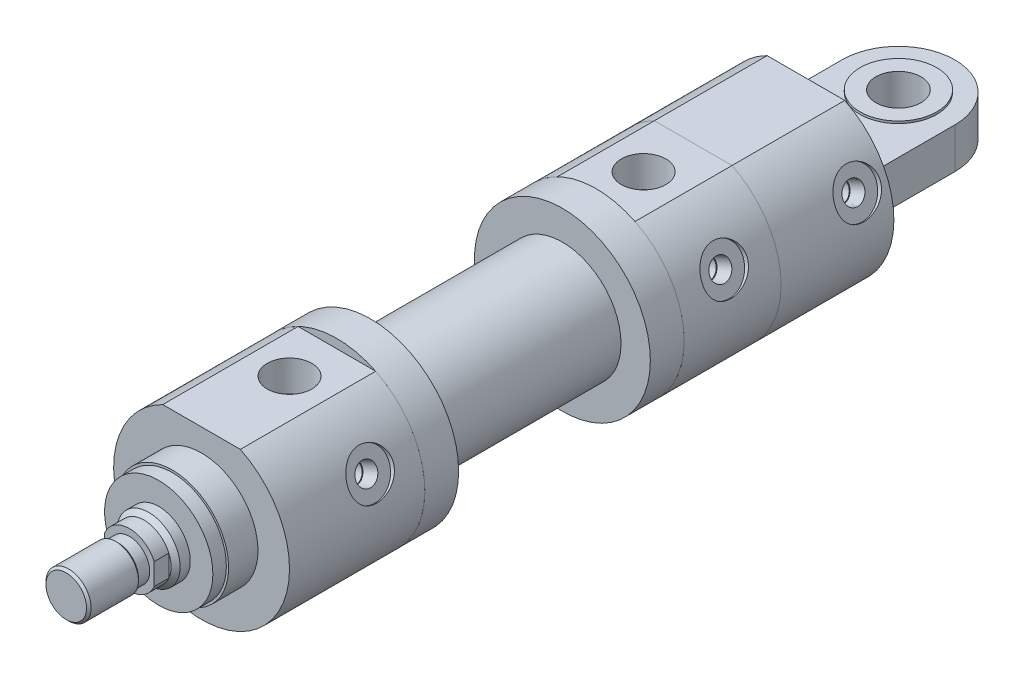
from build123d import *

# Parameters (mm, degrees)
ESQUISSE1_R             = 39
EXTRUSION1_DEPTH        = 43
ESQUISSE2_R             = 39
EXTRUSION2_DEPTH        = 15
ENL_V_START             = 35
ESQUISSE3_W             = 78
ESQUISSE3_H             = 43
ENL_V_MAT_EXTRU_1_DEPTH = 46.037491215
ESQUISSE6_R             = 26
EXTRUSION3_DEPTH        = 85
ESQUISSE7_R             = 39
EXTRUSION4_DEPTH        = 15
ESQUISSE8_R             = 39
EXTRUSION5_DEPTH        = 60
ESQUISSE9_W             = 78
ESQUISSE9_H             = 122
ENL_V_MAT_EXTRU_2_DEPTH = 57
ESQUISSE10_R            = 25
EXTRUSION6_DEPTH        = 13
ESQUISSE11_R            = 24
EXTRUSION7_DEPTH        = 6
ESQUISSE12_R            = 14
EXTRUSION8_DEPTH        = 6.5
CHANFREIN1_SIZE         = 2
ESQUISSE13_R            = 12
EXTRUSION9_DEPTH        = 6.5
ESQUISSE16_W            = 7.610310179
ESQUISSE16_H            = 44.412407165
ENL_V_MAT_EXTRU_4_DEPTH = 6.5
ESQUISSE17_R            = 39
EXTRUSION10_DEPTH       = 50
ESQUISSE18_W            = 78
ESQUISSE18_H            = 50
ENL_V_MAT_EXTRU_5_DEPTH = 249.418418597
ESQUISSE19_R            = 10
EXTRUSION11_DEPTH       = 9
ESQUISSE20_R            = 17
ESQUISSE20_R_2          = 10
EXTRUSION12_DEPTH       = 10
ENL_V_START_2           = 39
ESQUISSE21_R            = 10
ENL_V_MAT_EXTRU_6_DEPTH = 2
ESQUISSE22_R            = 10
ENL_V_MAT_EXTRU_7_DEPTH = 2
ESQUISSE23_R            = 10
ENL_V_MAT_EXTRU_8_DEPTH = 2


with BuildPart() as part:
    # Esquisse1 → Extrusion1 (new body)
    with BuildSketch(Plane.XY):
        Circle(ESQUISSE1_R)
    extrude(amount=EXTRUSION1_DEPTH)

    # Esquisse3 → Enl_v. mat.-Extru.1 (cut, through all)
    with BuildSketch(Plane(origin=(0, 0, 0), x_dir=(1, 0, 0), z_dir=(0, 1, 0)).offset(ENL_V_START)):
        with Locations((0, -21.5)):
            Rectangle(ESQUISSE3_W, ESQUISSE3_H)
    extrude(amount=ENL_V_MAT_EXTRU_1_DEPTH, mode=Mode.SUBTRACT)

    # Sketch 2 → Trou taraud_ 1_2 NPT1 (revolve, cut)
    with BuildSketch(Plane(origin=(0, 35, 22), x_dir=(0, 0, 1), z_dir=(1, 0, 0))):
        Polygon((0, 0), (0, 28.003543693), (8.9281, 22.639), (8.9281, 13.5712), (9.479721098, 13.5712), (9.886061, 0), align=None)
    revolve(axis=Axis((0, 41.35, 22), (0, -1, 0)), mode=Mode.SUBTRACT)

    # Esquisse22 → Enl_v. mat.-Extru.7 (cut)
    with BuildSketch(Plane(origin=(0, 0, 0), x_dir=(0, 0, -1), z_dir=(0.92050485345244, 0.39073112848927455, 0)).offset(ENL_V_START_2)):
        with Locations(Location((-22, 0, 0), (0, 0, 90))):
            Circle(ESQUISSE22_R)
    extrude(amount=-ENL_V_MAT_EXTRU_7_DEPTH, mode=Mode.SUBTRACT)

    # Sketch 4 → Trou taraud_ 1_8 NPT2 (revolve, cut)
    with BuildSketch(Plane(origin=(34.058679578, 14.457051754, 22), x_dir=(-0.39073112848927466, 0.92050485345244, 0), z_dir=(0, 0, 1))):
        Polygon((0, 0), (0, 14.156468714), (4.2164, 11.623), (4.2164, 6.92404), (4.53740497, 6.92404), (4.74472, 0), align=None)
    revolve(axis=Axis((39.903885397, 16.93819442, 22), (-0.92050485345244, -0.3907311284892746, 0)), mode=Mode.SUBTRACT)


with BuildPart() as body_2:
    # Esquisse2 → Extrusion2 (new body)
    with BuildSketch(Plane.XY.offset(43)):
        Circle(ESQUISSE2_R)
    extrude(amount=EXTRUSION2_DEPTH)

    # Esquisse6 → Extrusion3 (add)
    with BuildSketch(Plane.XY.offset(58)):
        Circle(ESQUISSE6_R)
    extrude(amount=EXTRUSION3_DEPTH)

    # Esquisse7 → Extrusion4 (add)
    with BuildSketch(Plane.XY.offset(143)):
        Circle(ESQUISSE7_R)
    extrude(amount=EXTRUSION4_DEPTH)


with BuildPart() as body_3:
    # Esquisse8 → Extrusion5 (new body)
    with BuildSketch(Plane.XY.offset(158)):
        Circle(ESQUISSE8_R)
    extrude(amount=EXTRUSION5_DEPTH)

    # Esquisse9 → Enl_v. mat.-Extru.2 (cut)
    with BuildSketch(Plane(origin=(0, 0, 0), x_dir=(1, 0, 0), z_dir=(0, 1, 0)).offset(ENL_V_START)):
        with Locations((0, -157)):
            Rectangle(ESQUISSE9_W, ESQUISSE9_H)
    extrude(amount=ENL_V_MAT_EXTRU_2_DEPTH, mode=Mode.SUBTRACT)

    # Sketch 2 2 → Trou taraud_ 1_2 NPT2 (revolve, cut)
    with BuildSketch(Plane(origin=(0, 35, 179), x_dir=(0, 0, 1), z_dir=(1, 0, 0))):
        Polygon((0, 0), (0, 28.003543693), (8.9281, 22.639), (8.9281, 13.5712), (9.479721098, 13.5712), (9.886061, 0), align=None)
    revolve(axis=Axis((0, 41.35, 179), (0, -1, 0)), mode=Mode.SUBTRACT)

    # Esquisse10 → Extrusion6 (add)
    with BuildSketch(Plane.XY.offset(218)):
        with Locations(Location((0, 0, 0), (0, 0, 180))):
            Circle(ESQUISSE10_R)
    extrude(amount=EXTRUSION6_DEPTH)

    # Esquisse11 → Extrusion7 (add)
    with BuildSketch(Plane.XY.offset(231)):
        Circle(ESQUISSE11_R)
    extrude(amount=EXTRUSION7_DEPTH)

    # Esquisse12 → Extrusion8 (add)
    with BuildSketch(Plane.XY.offset(237)):
        with Locations(Location((0, 0, 0), (0, 0, 180))):
            Circle(ESQUISSE12_R)
    extrude(amount=EXTRUSION8_DEPTH)

    # Chanfrein1
    chanfrein1_edges = [body_3.edges().sort_by_distance(p)[0] for p in [
        (14, 0, 243.5),
    ]]
    chamfer(chanfrein1_edges, length=CHANFREIN1_SIZE)

    # Esquisse13 → Extrusion9 (add)
    with BuildSketch(Plane.XY.offset(243.5)):
        with Locations(Location((0, 0, 0), (0, 0, 180))):
            Circle(ESQUISSE13_R)
    extrude(amount=EXTRUSION9_DEPTH)

    # Esquisse15 → R_volution1 (revolve)
    with BuildSketch(Plane(origin=(0, 0, 0), x_dir=(0, 0, -1), z_dir=(1, 0, 0)), mode=Mode.PRIVATE) as r_volution1_sk:
        Polygon((-250, 9), (-255, 9), (-256, 10), (-277, 10), (-278, 9), (-278, 0), (-250, 0), align=None)
    revolve(r_volution1_sk.sketch.rotate(Axis((0, 0, 208.245925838), (0, 0, -1)), 90), axis=Axis((0, 0, 208.245925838), (0, 0, -1)))

    # Esquisse16 → Enl_v. mat.-Extru.4 (cut)
    with BuildSketch(Plane.XY.offset(250)):
        with Locations((14.80515509, -0.908693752)):
            Rectangle(ESQUISSE16_W, ESQUISSE16_H)
        with Locations((-14.80515509, -0.908693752)):
            Rectangle(ESQUISSE16_W, ESQUISSE16_H)
    extrude(amount=-ENL_V_MAT_EXTRU_4_DEPTH, mode=Mode.SUBTRACT)

    # Esquisse21 → Enl_v. mat.-Extru.6 (cut)
    with BuildSketch(Plane(origin=(0, 0, 0), x_dir=(0, 0, -1), z_dir=(0.92050485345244, 0.39073112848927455, 0)).offset(ENL_V_START_2)):
        with Locations(Location((-179, 0, 0), (0, 0, 90))):
            Circle(ESQUISSE21_R)
    extrude(amount=-ENL_V_MAT_EXTRU_6_DEPTH, mode=Mode.SUBTRACT)

    # Sketch 6 → Trou taraud_ 1_8 NPT1 (revolve, cut)
    with BuildSketch(Plane(origin=(34.058679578, 14.457051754, 179), x_dir=(-0.39073112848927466, 0.92050485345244, 0), z_dir=(0, 0, 1))):
        Polygon((0, 0), (0, 14.156508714), (4.2164, 11.62304), (4.2164, 6.92404), (4.53740497, 6.92404), (4.74472, 0), align=None)
    revolve(axis=Axis((39.903885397, 16.93819442, 179), (-0.9205048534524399, -0.3907311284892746, 0)), mode=Mode.SUBTRACT)


with BuildPart() as body_4:
    # Esquisse17 → Extrusion10 (new body)
    with BuildSketch(Plane(origin=(0, 0, 0), x_dir=(-1, 0, 0), z_dir=(0, 0, -1))):
        Circle(ESQUISSE17_R)
    extrude(amount=EXTRUSION10_DEPTH)

    # Esquisse18 → Enl_v. mat.-Extru.5 (cut, through all)
    with BuildSketch(Plane(origin=(0, 0, 0), x_dir=(1, 0, 0), z_dir=(0, 1, 0)).offset(ENL_V_START)):
        with Locations((0, 25)):
            Rectangle(ESQUISSE18_W, ESQUISSE18_H)
    extrude(amount=ENL_V_MAT_EXTRU_5_DEPTH, mode=Mode.SUBTRACT)

    # Esquisse19 → Extrusion11 (add, symmetric)
    with BuildSketch(Plane(origin=(0, 0, 0), x_dir=(0, 0, -1), z_dir=(0, 1, 0))):
        with BuildLine():
            Line((50, 25), (91, 25))
            ThreePointArc((91, 25), (116, 0), (91, -25))
            Line((91, -25), (50, -25))
            Line((50, -25), (50, 25))
        make_face()
        with Locations(Location((91, 0, 0), (0, 0, 180))):
            Circle(ESQUISSE19_R, mode=Mode.SUBTRACT)
    extrude(amount=EXTRUSION11_DEPTH, both=True)

    # Esquisse20 → Extrusion12 (add, symmetric)
    with BuildSketch(Plane(origin=(0, 0, 0), x_dir=(0, 0, -1), z_dir=(0, 1, 0))):
        with Locations((91, 0)):
            Circle(ESQUISSE20_R)
        with Locations(Location((91, 0, 0), (0, 0, 180))):
            Circle(ESQUISSE20_R_2, mode=Mode.SUBTRACT)
    extrude(amount=EXTRUSION12_DEPTH, both=True)

    # Esquisse23 → Enl_v. mat.-Extru.8 (cut)
    with BuildSketch(Plane(origin=(0, 0, 0), x_dir=(0, 0, -1), z_dir=(0.92050485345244, 0.39073112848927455, 0)).offset(ENL_V_START_2)):
        with Locations(Location((37, 0, 0), (0, 0, 90))):
            Circle(ESQUISSE23_R)
    extrude(amount=-ENL_V_MAT_EXTRU_8_DEPTH, mode=Mode.SUBTRACT)

    # Sketch 6 2 → Trou taraud_ 1_8 NPT3 (revolve, cut)
    with BuildSketch(Plane(origin=(34.058679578, 14.457051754, -37), x_dir=(-0.39073112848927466, 0.92050485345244, 0), z_dir=(0, 0, 1))):
        Polygon((0, 0), (0, 14.156468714), (4.2164, 11.623), (4.2164, 6.92404), (4.53740497, 6.92404), (4.74472, 0), align=None)
    revolve(axis=Axis((39.903885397, 16.93819442, -37), (-0.9205048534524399, -0.3907311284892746, 0)), mode=Mode.SUBTRACT)


solid = Compound([part.part, body_2.part, body_3.part, body_4.part])
